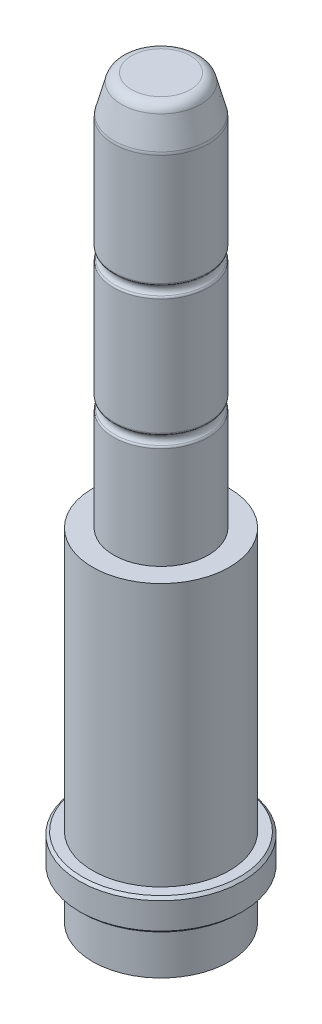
ISO-10303-21;
HEADER;
FILE_DESCRIPTION(('STEP AP214'),'2;1');
FILE_NAME('part.step','',(''),(''),'','','');
FILE_SCHEMA(('AUTOMOTIVE_DESIGN { 1 0 10303 214 1 1 1 1 }'));
ENDSEC;
DATA;
#1=APPLICATION_CONTEXT('core data for automotive mechanical design processes');
#2=APPLICATION_PROTOCOL_DEFINITION('international standard','automotive_design',2000,#1);
#3=PRODUCT_CONTEXT('',#1,'mechanical');
#4=PRODUCT('Part','Part','',(#3));
#5=PRODUCT_RELATED_PRODUCT_CATEGORY('part','',(#4));
#6=PRODUCT_DEFINITION_FORMATION('','',#4);
#7=PRODUCT_DEFINITION_CONTEXT('part definition',#1,'design');
#8=PRODUCT_DEFINITION('design','',#6,#7);
#9=PRODUCT_DEFINITION_SHAPE('','',#8);
#10=(LENGTH_UNIT() NAMED_UNIT(*) SI_UNIT(.MILLI.,.METRE.));
#11=(NAMED_UNIT(*) PLANE_ANGLE_UNIT() SI_UNIT($,.RADIAN.));
#12=(NAMED_UNIT(*) SI_UNIT($,.STERADIAN.) SOLID_ANGLE_UNIT());
#13=UNCERTAINTY_MEASURE_WITH_UNIT(LENGTH_MEASURE(1.E-05),#10,'distance_accuracy_value','');
#14=(GEOMETRIC_REPRESENTATION_CONTEXT(3) GLOBAL_UNCERTAINTY_ASSIGNED_CONTEXT((#13)) GLOBAL_UNIT_ASSIGNED_CONTEXT((#10,
#11,#12)) REPRESENTATION_CONTEXT('',''));
#15=CARTESIAN_POINT('',(0.,0.,0.));
#16=DIRECTION('',(0.,0.,1.));
#17=DIRECTION('',(1.,0.,0.));
#18=AXIS2_PLACEMENT_3D('',#15,#16,#17);
#19=CARTESIAN_POINT('',(0.,6.,0.));
#20=DIRECTION('',(0.,-1.,0.));
#21=DIRECTION('',(0.,0.,-1.));
#22=AXIS2_PLACEMENT_3D('',#19,#20,#21);
#23=CYLINDRICAL_SURFACE('',#22,15.5);
#24=CARTESIAN_POINT('',(0.,5.5,0.));
#25=DIRECTION('',(0.,1.,0.));
#26=DIRECTION('',(0.,0.,1.));
#27=AXIS2_PLACEMENT_3D('',#24,#25,#26);
#28=CIRCLE('',#27,15.5);
#29=CARTESIAN_POINT('',(0.,5.5,15.5));
#30=VERTEX_POINT('',#29);
#31=EDGE_CURVE('E22',#30,#30,#28,.F.);
#32=ORIENTED_EDGE('',*,*,#31,.T.);
#33=EDGE_LOOP('',(#32));
#34=FACE_BOUND('',#33,.T.);
#35=CARTESIAN_POINT('',(0.,0.5,0.));
#36=DIRECTION('',(0.,1.,0.));
#37=DIRECTION('',(0.,0.,1.));
#38=AXIS2_PLACEMENT_3D('',#35,#36,#37);
#39=CIRCLE('',#38,15.5);
#40=CARTESIAN_POINT('',(0.,0.5,15.5));
#41=VERTEX_POINT('',#40);
#42=EDGE_CURVE('E30',#41,#41,#39,.T.);
#43=ORIENTED_EDGE('',*,*,#42,.T.);
#44=EDGE_LOOP('',(#43));
#45=FACE_BOUND('',#44,.T.);
#46=ADVANCED_FACE('F14',(#34,#45),#23,.T.);
#47=CARTESIAN_POINT('',(0.,6.,0.));
#48=DIRECTION('',(0.,1.,0.));
#49=DIRECTION('',(0.,0.,1.));
#50=AXIS2_PLACEMENT_3D('',#47,#48,#49);
#51=PLANE('',#50);
#52=CARTESIAN_POINT('',(0.,6.,0.));
#53=DIRECTION('',(0.,1.,0.));
#54=DIRECTION('',(0.,0.,1.));
#55=AXIS2_PLACEMENT_3D('',#52,#53,#54);
#56=CIRCLE('',#55,15.);
#57=CARTESIAN_POINT('',(0.,6.,15.));
#58=VERTEX_POINT('',#57);
#59=EDGE_CURVE('E37',#58,#58,#56,.T.);
#60=ORIENTED_EDGE('',*,*,#59,.T.);
#61=EDGE_LOOP('',(#60));
#62=FACE_BOUND('',#61,.T.);
#63=CARTESIAN_POINT('',(0.,6.,0.));
#64=DIRECTION('',(0.,-1.,0.));
#65=DIRECTION('',(0.,0.,-1.));
#66=AXIS2_PLACEMENT_3D('',#63,#64,#65);
#67=CIRCLE('',#66,13.);
#68=CARTESIAN_POINT('',(0.,6.,-13.));
#69=VERTEX_POINT('',#68);
#70=EDGE_CURVE('E48',#69,#69,#67,.T.);
#71=ORIENTED_EDGE('',*,*,#70,.T.);
#72=EDGE_LOOP('',(#71));
#73=FACE_BOUND('',#72,.T.);
#74=ADVANCED_FACE('F125',(#62,#73),#51,.T.);
#75=CARTESIAN_POINT('',(0.,0.,0.));
#76=DIRECTION('',(0.,1.,0.));
#77=DIRECTION('',(0.,0.,1.));
#78=AXIS2_PLACEMENT_3D('',#75,#76,#77);
#79=PLANE('',#78);
#80=CARTESIAN_POINT('',(0.,0.,0.));
#81=DIRECTION('',(0.,1.,0.));
#82=DIRECTION('',(0.,0.,1.));
#83=AXIS2_PLACEMENT_3D('',#80,#81,#82);
#84=CIRCLE('',#83,15.);
#85=CARTESIAN_POINT('',(0.,0.,15.));
#86=VERTEX_POINT('',#85);
#87=EDGE_CURVE('E9',#86,#86,#84,.F.);
#88=ORIENTED_EDGE('',*,*,#87,.T.);
#89=EDGE_LOOP('',(#88));
#90=FACE_BOUND('',#89,.T.);
#91=CARTESIAN_POINT('',(0.,0.,0.));
#92=DIRECTION('',(0.,1.,0.));
#93=DIRECTION('',(0.,0.,1.));
#94=AXIS2_PLACEMENT_3D('',#91,#92,#93);
#95=CIRCLE('',#94,13.);
#96=CARTESIAN_POINT('',(0.,0.,13.));
#97=VERTEX_POINT('',#96);
#98=EDGE_CURVE('E103',#97,#97,#95,.T.);
#99=ORIENTED_EDGE('',*,*,#98,.T.);
#100=EDGE_LOOP('',(#99));
#101=FACE_BOUND('',#100,.T.);
#102=ADVANCED_FACE('F108',(#90,#101),#79,.F.);
#103=CARTESIAN_POINT('',(0.,56.,0.));
#104=DIRECTION('',(0.,-1.,0.));
#105=DIRECTION('',(0.,0.,-1.));
#106=AXIS2_PLACEMENT_3D('',#103,#104,#105);
#107=PLANE('',#106);
#108=CARTESIAN_POINT('',(0.,56.,0.));
#109=DIRECTION('',(0.,1.,0.));
#110=DIRECTION('',(0.,0.,1.));
#111=AXIS2_PLACEMENT_3D('',#108,#109,#110);
#112=CIRCLE('',#111,9.);
#113=CARTESIAN_POINT('',(0.,56.,8.99999999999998));
#114=VERTEX_POINT('',#113);
#115=EDGE_CURVE('E43',#114,#114,#112,.T.);
#116=ORIENTED_EDGE('',*,*,#115,.F.);
#117=EDGE_LOOP('',(#116));
#118=FACE_BOUND('',#117,.T.);
#119=CARTESIAN_POINT('',(0.,56.,0.));
#120=DIRECTION('',(0.,-1.,0.));
#121=DIRECTION('',(0.,0.,-1.));
#122=AXIS2_PLACEMENT_3D('',#119,#120,#121);
#123=CIRCLE('',#122,13.);
#124=CARTESIAN_POINT('',(0.,56.,-13.));
#125=VERTEX_POINT('',#124);
#126=EDGE_CURVE('E44',#125,#125,#123,.T.);
#127=ORIENTED_EDGE('',*,*,#126,.F.);
#128=EDGE_LOOP('',(#127));
#129=FACE_BOUND('',#128,.T.);
#130=ADVANCED_FACE('F134',(#118,#129),#107,.F.);
#131=CARTESIAN_POINT('',(0.,6.,0.));
#132=DIRECTION('',(0.,-1.,0.));
#133=DIRECTION('',(0.,0.,-1.));
#134=AXIS2_PLACEMENT_3D('',#131,#132,#133);
#135=CYLINDRICAL_SURFACE('',#134,13.);
#136=ORIENTED_EDGE('',*,*,#70,.F.);
#137=EDGE_LOOP('',(#136));
#138=FACE_BOUND('',#137,.T.);
#139=ORIENTED_EDGE('',*,*,#126,.T.);
#140=EDGE_LOOP('',(#139));
#141=FACE_BOUND('',#140,.T.);
#142=ADVANCED_FACE('F138',(#138,#141),#135,.T.);
#143=CARTESIAN_POINT('',(0.,131.,0.));
#144=DIRECTION('',(0.,1.,0.));
#145=DIRECTION('',(0.,0.,1.));
#146=AXIS2_PLACEMENT_3D('',#143,#144,#145);
#147=PLANE('',#146);
#148=CARTESIAN_POINT('',(0.,131.,0.));
#149=DIRECTION('',(0.,1.,0.));
#150=DIRECTION('',(0.,0.,1.));
#151=AXIS2_PLACEMENT_3D('',#148,#149,#150);
#152=CIRCLE('',#151,5.5897016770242);
#153=CARTESIAN_POINT('',(0.,131.,5.5897016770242));
#154=VERTEX_POINT('',#153);
#155=EDGE_CURVE('E52',#154,#154,#152,.T.);
#156=ORIENTED_EDGE('',*,*,#155,.T.);
#157=EDGE_LOOP('',(#156));
#158=FACE_BOUND('',#157,.T.);
#159=ADVANCED_FACE('F142',(#158),#147,.T.);
#160=CARTESIAN_POINT('',(0.,129.,0.));
#161=DIRECTION('',(0.,1.,0.));
#162=DIRECTION('',(0.,0.,1.));
#163=AXIS2_PLACEMENT_3D('',#160,#161,#162);
#164=TOROIDAL_SURFACE('',#163,5.5897016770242,2.);
#165=CARTESIAN_POINT('',(0.,129.517638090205,0.));
#166=DIRECTION('',(0.,1.,0.));
#167=DIRECTION('',(0.,0.,1.));
#168=AXIS2_PLACEMENT_3D('',#165,#166,#167);
#169=CIRCLE('',#168,7.52155332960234);
#170=CARTESIAN_POINT('',(0.,129.517638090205,7.52155332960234));
#171=VERTEX_POINT('',#170);
#172=EDGE_CURVE('E56',#171,#171,#169,.T.);
#173=ORIENTED_EDGE('',*,*,#172,.T.);
#174=EDGE_LOOP('',(#173));
#175=FACE_BOUND('',#174,.T.);
#176=ORIENTED_EDGE('',*,*,#155,.F.);
#177=EDGE_LOOP('',(#176));
#178=FACE_BOUND('',#177,.T.);
#179=ADVANCED_FACE('F146',(#175,#178),#164,.T.);
#180=CARTESIAN_POINT('',(0.,129.517638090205,0.));
#181=DIRECTION('',(0.,-1.,0.));
#182=DIRECTION('',(0.,0.,-1.));
#183=AXIS2_PLACEMENT_3D('',#180,#181,#182);
#184=CONICAL_SURFACE('',#183,7.52155332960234,0.261799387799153);
#185=CARTESIAN_POINT('',(0.,124.25433309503,0.));
#186=DIRECTION('',(0.,1.,0.));
#187=DIRECTION('',(0.,0.,1.));
#188=AXIS2_PLACEMENT_3D('',#185,#186,#187);
#189=CIRCLE('',#188,8.93185165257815);
#190=CARTESIAN_POINT('',(0.,124.25433309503,8.93185165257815));
#191=VERTEX_POINT('',#190);
#192=EDGE_CURVE('E59',#191,#191,#189,.T.);
#193=ORIENTED_EDGE('',*,*,#192,.T.);
#194=EDGE_LOOP('',(#193));
#195=FACE_BOUND('',#194,.T.);
#196=ORIENTED_EDGE('',*,*,#172,.F.);
#197=EDGE_LOOP('',(#196));
#198=FACE_BOUND('',#197,.T.);
#199=ADVANCED_FACE('F150',(#195,#198),#184,.T.);
#200=CARTESIAN_POINT('',(0.,123.736695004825,0.));
#201=DIRECTION('',(0.,1.,0.));
#202=DIRECTION('',(0.,0.,1.));
#203=AXIS2_PLACEMENT_3D('',#200,#201,#202);
#204=TOROIDAL_SURFACE('',#203,7.,2.);
#205=CARTESIAN_POINT('',(0.,123.736695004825,0.));
#206=DIRECTION('',(0.,1.,0.));
#207=DIRECTION('',(0.,0.,1.));
#208=AXIS2_PLACEMENT_3D('',#205,#206,#207);
#209=CIRCLE('',#208,9.);
#210=CARTESIAN_POINT('',(0.,123.736695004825,9.));
#211=VERTEX_POINT('',#210);
#212=EDGE_CURVE('E63',#211,#211,#209,.T.);
#213=ORIENTED_EDGE('',*,*,#212,.T.);
#214=EDGE_LOOP('',(#213));
#215=FACE_BOUND('',#214,.T.);
#216=ORIENTED_EDGE('',*,*,#192,.F.);
#217=EDGE_LOOP('',(#216));
#218=FACE_BOUND('',#217,.T.);
#219=ADVANCED_FACE('F154',(#215,#218),#204,.T.);
#220=CARTESIAN_POINT('',(0.,131.,0.));
#221=DIRECTION('',(0.,1.,0.));
#222=DIRECTION('',(0.,0.,1.));
#223=AXIS2_PLACEMENT_3D('',#220,#221,#222);
#224=CYLINDRICAL_SURFACE('',#223,9.);
#225=CARTESIAN_POINT('',(0.,102.605352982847,0.));
#226=DIRECTION('',(0.,1.,0.));
#227=DIRECTION('',(0.,0.,1.));
#228=AXIS2_PLACEMENT_3D('',#225,#226,#227);
#229=CIRCLE('',#228,9.);
#230=CARTESIAN_POINT('',(0.,102.605352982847,8.99999999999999));
#231=VERTEX_POINT('',#230);
#232=EDGE_CURVE('E67',#231,#231,#229,.T.);
#233=ORIENTED_EDGE('',*,*,#232,.T.);
#234=EDGE_LOOP('',(#233));
#235=FACE_BOUND('',#234,.T.);
#236=ORIENTED_EDGE('',*,*,#212,.F.);
#237=EDGE_LOOP('',(#236));
#238=FACE_BOUND('',#237,.T.);
#239=ADVANCED_FACE('F158',(#235,#238),#224,.T.);
#240=CARTESIAN_POINT('',(0.,102.605352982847,0.));
#241=DIRECTION('',(0.,1.,0.));
#242=DIRECTION('',(0.,0.,1.));
#243=AXIS2_PLACEMENT_3D('',#240,#241,#242);
#244=TOROIDAL_SURFACE('',#243,8.5,0.5);
#245=CARTESIAN_POINT('',(0.,102.212277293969,0.));
#246=DIRECTION('',(0.,1.,0.));
#247=DIRECTION('',(0.,0.,1.));
#248=AXIS2_PLACEMENT_3D('',#245,#246,#247);
#249=CIRCLE('',#248,8.80901699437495);
#250=CARTESIAN_POINT('',(0.,102.212277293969,8.80901699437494));
#251=VERTEX_POINT('',#250);
#252=EDGE_CURVE('E71',#251,#251,#249,.T.);
#253=ORIENTED_EDGE('',*,*,#252,.T.);
#254=EDGE_LOOP('',(#253));
#255=FACE_BOUND('',#254,.T.);
#256=ORIENTED_EDGE('',*,*,#232,.F.);
#257=EDGE_LOOP('',(#256));
#258=FACE_BOUND('',#257,.T.);
#259=ADVANCED_FACE('F162',(#255,#258),#244,.T.);
#260=CARTESIAN_POINT('',(0.,101.333333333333,0.));
#261=DIRECTION('',(0.,1.,0.));
#262=DIRECTION('',(0.,0.,1.));
#263=AXIS2_PLACEMENT_3D('',#260,#261,#262);
#264=TOROIDAL_SURFACE('',#263,9.5,1.11803398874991);
#265=CARTESIAN_POINT('',(0.,100.454389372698,0.));
#266=DIRECTION('',(0.,1.,0.));
#267=DIRECTION('',(0.,0.,1.));
#268=AXIS2_PLACEMENT_3D('',#265,#266,#267);
#269=CIRCLE('',#268,8.80901699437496);
#270=CARTESIAN_POINT('',(0.,100.454389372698,8.80901699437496));
#271=VERTEX_POINT('',#270);
#272=EDGE_CURVE('E74',#271,#271,#269,.T.);
#273=ORIENTED_EDGE('',*,*,#272,.T.);
#274=EDGE_LOOP('',(#273));
#275=FACE_BOUND('',#274,.T.);
#276=ORIENTED_EDGE('',*,*,#252,.F.);
#277=EDGE_LOOP('',(#276));
#278=FACE_BOUND('',#277,.T.);
#279=ADVANCED_FACE('F166',(#275,#278),#264,.F.);
#280=CARTESIAN_POINT('',(0.,100.061313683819,0.));
#281=DIRECTION('',(0.,1.,0.));
#282=DIRECTION('',(0.,0.,1.));
#283=AXIS2_PLACEMENT_3D('',#280,#281,#282);
#284=TOROIDAL_SURFACE('',#283,8.5,0.5);
#285=CARTESIAN_POINT('',(0.,100.061313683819,0.));
#286=DIRECTION('',(0.,1.,0.));
#287=DIRECTION('',(0.,0.,1.));
#288=AXIS2_PLACEMENT_3D('',#285,#286,#287);
#289=CIRCLE('',#288,9.);
#290=CARTESIAN_POINT('',(0.,100.061313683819,8.99999999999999));
#291=VERTEX_POINT('',#290);
#292=EDGE_CURVE('E77',#291,#291,#289,.T.);
#293=ORIENTED_EDGE('',*,*,#292,.T.);
#294=EDGE_LOOP('',(#293));
#295=FACE_BOUND('',#294,.T.);
#296=ORIENTED_EDGE('',*,*,#272,.F.);
#297=EDGE_LOOP('',(#296));
#298=FACE_BOUND('',#297,.T.);
#299=ADVANCED_FACE('F170',(#295,#298),#284,.T.);
#300=CARTESIAN_POINT('',(0.,131.,0.));
#301=DIRECTION('',(0.,1.,0.));
#302=DIRECTION('',(0.,0.,1.));
#303=AXIS2_PLACEMENT_3D('',#300,#301,#302);
#304=CYLINDRICAL_SURFACE('',#303,9.);
#305=CARTESIAN_POINT('',(0.,77.9386863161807,0.));
#306=DIRECTION('',(0.,1.,0.));
#307=DIRECTION('',(0.,0.,1.));
#308=AXIS2_PLACEMENT_3D('',#305,#306,#307);
#309=CIRCLE('',#308,9.);
#310=CARTESIAN_POINT('',(0.,77.9386863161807,8.99999999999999));
#311=VERTEX_POINT('',#310);
#312=EDGE_CURVE('E81',#311,#311,#309,.T.);
#313=ORIENTED_EDGE('',*,*,#312,.T.);
#314=EDGE_LOOP('',(#313));
#315=FACE_BOUND('',#314,.T.);
#316=ORIENTED_EDGE('',*,*,#292,.F.);
#317=EDGE_LOOP('',(#316));
#318=FACE_BOUND('',#317,.T.);
#319=ADVANCED_FACE('F174',(#315,#318),#304,.T.);
#320=CARTESIAN_POINT('',(0.,77.9386863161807,0.));
#321=DIRECTION('',(0.,1.,0.));
#322=DIRECTION('',(0.,0.,1.));
#323=AXIS2_PLACEMENT_3D('',#320,#321,#322);
#324=TOROIDAL_SURFACE('',#323,8.5,0.5);
#325=CARTESIAN_POINT('',(0.,77.545610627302,0.));
#326=DIRECTION('',(0.,1.,0.));
#327=DIRECTION('',(0.,0.,1.));
#328=AXIS2_PLACEMENT_3D('',#325,#326,#327);
#329=CIRCLE('',#328,8.80901699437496);
#330=CARTESIAN_POINT('',(0.,77.545610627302,8.80901699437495));
#331=VERTEX_POINT('',#330);
#332=EDGE_CURVE('E85',#331,#331,#329,.T.);
#333=ORIENTED_EDGE('',*,*,#332,.T.);
#334=EDGE_LOOP('',(#333));
#335=FACE_BOUND('',#334,.T.);
#336=ORIENTED_EDGE('',*,*,#312,.F.);
#337=EDGE_LOOP('',(#336));
#338=FACE_BOUND('',#337,.T.);
#339=ADVANCED_FACE('F178',(#335,#338),#324,.T.);
#340=CARTESIAN_POINT('',(0.,76.6666666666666,0.));
#341=DIRECTION('',(0.,1.,0.));
#342=DIRECTION('',(0.,0.,1.));
#343=AXIS2_PLACEMENT_3D('',#340,#341,#342);
#344=TOROIDAL_SURFACE('',#343,9.5,1.11803398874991);
#345=CARTESIAN_POINT('',(0.,75.7877227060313,0.));
#346=DIRECTION('',(0.,1.,0.));
#347=DIRECTION('',(0.,0.,1.));
#348=AXIS2_PLACEMENT_3D('',#345,#346,#347);
#349=CIRCLE('',#348,8.80901699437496);
#350=CARTESIAN_POINT('',(0.,75.7877227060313,8.80901699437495));
#351=VERTEX_POINT('',#350);
#352=EDGE_CURVE('E89',#351,#351,#349,.T.);
#353=ORIENTED_EDGE('',*,*,#352,.T.);
#354=EDGE_LOOP('',(#353));
#355=FACE_BOUND('',#354,.T.);
#356=ORIENTED_EDGE('',*,*,#332,.F.);
#357=EDGE_LOOP('',(#356));
#358=FACE_BOUND('',#357,.T.);
#359=ADVANCED_FACE('F182',(#355,#358),#344,.F.);
#360=CARTESIAN_POINT('',(0.,75.3946470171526,0.));
#361=DIRECTION('',(0.,1.,0.));
#362=DIRECTION('',(0.,0.,1.));
#363=AXIS2_PLACEMENT_3D('',#360,#361,#362);
#364=TOROIDAL_SURFACE('',#363,8.5,0.5);
#365=CARTESIAN_POINT('',(0.,75.3946470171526,0.));
#366=DIRECTION('',(0.,1.,0.));
#367=DIRECTION('',(0.,0.,1.));
#368=AXIS2_PLACEMENT_3D('',#365,#366,#367);
#369=CIRCLE('',#368,9.);
#370=CARTESIAN_POINT('',(0.,75.3946470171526,8.99999999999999));
#371=VERTEX_POINT('',#370);
#372=EDGE_CURVE('E93',#371,#371,#369,.T.);
#373=ORIENTED_EDGE('',*,*,#372,.T.);
#374=EDGE_LOOP('',(#373));
#375=FACE_BOUND('',#374,.T.);
#376=ORIENTED_EDGE('',*,*,#352,.F.);
#377=EDGE_LOOP('',(#376));
#378=FACE_BOUND('',#377,.T.);
#379=ADVANCED_FACE('F186',(#375,#378),#364,.T.);
#380=CARTESIAN_POINT('',(0.,131.,0.));
#381=DIRECTION('',(0.,1.,0.));
#382=DIRECTION('',(0.,0.,1.));
#383=AXIS2_PLACEMENT_3D('',#380,#381,#382);
#384=CYLINDRICAL_SURFACE('',#383,9.);
#385=ORIENTED_EDGE('',*,*,#115,.T.);
#386=EDGE_LOOP('',(#385));
#387=FACE_BOUND('',#386,.T.);
#388=ORIENTED_EDGE('',*,*,#372,.F.);
#389=EDGE_LOOP('',(#388));
#390=FACE_BOUND('',#389,.T.);
#391=ADVANCED_FACE('F121',(#387,#390),#384,.T.);
#392=CARTESIAN_POINT('',(0.,-9.,0.));
#393=DIRECTION('',(0.,-1.,0.));
#394=DIRECTION('',(0.,0.,-1.));
#395=AXIS2_PLACEMENT_3D('',#392,#393,#394);
#396=PLANE('',#395);
#397=CARTESIAN_POINT('',(0.,-9.,0.));
#398=DIRECTION('',(0.,1.,0.));
#399=DIRECTION('',(0.,0.,1.));
#400=AXIS2_PLACEMENT_3D('',#397,#398,#399);
#401=CIRCLE('',#400,13.);
#402=CARTESIAN_POINT('',(0.,-9.,13.));
#403=VERTEX_POINT('',#402);
#404=EDGE_CURVE('E96',#403,#403,#401,.T.);
#405=ORIENTED_EDGE('',*,*,#404,.F.);
#406=EDGE_LOOP('',(#405));
#407=FACE_BOUND('',#406,.T.);
#408=ADVANCED_FACE('F113',(#407),#396,.T.);
#409=CARTESIAN_POINT('',(0.,0.,0.));
#410=DIRECTION('',(0.,1.,0.));
#411=DIRECTION('',(0.,0.,1.));
#412=AXIS2_PLACEMENT_3D('',#409,#410,#411);
#413=CYLINDRICAL_SURFACE('',#412,13.);
#414=ORIENTED_EDGE('',*,*,#404,.T.);
#415=EDGE_LOOP('',(#414));
#416=FACE_BOUND('',#415,.T.);
#417=ORIENTED_EDGE('',*,*,#98,.F.);
#418=EDGE_LOOP('',(#417));
#419=FACE_BOUND('',#418,.T.);
#420=ADVANCED_FACE('F110',(#416,#419),#413,.T.);
#421=CARTESIAN_POINT('',(0.,6.,0.));
#422=DIRECTION('',(0.,-1.,0.));
#423=DIRECTION('',(0.,0.,-1.));
#424=AXIS2_PLACEMENT_3D('',#421,#422,#423);
#425=CONICAL_SURFACE('',#424,15.,0.785398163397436);
#426=ORIENTED_EDGE('',*,*,#31,.F.);
#427=EDGE_LOOP('',(#426));
#428=FACE_BOUND('',#427,.T.);
#429=ORIENTED_EDGE('',*,*,#59,.F.);
#430=EDGE_LOOP('',(#429));
#431=FACE_BOUND('',#430,.T.);
#432=ADVANCED_FACE('F112',(#428,#431),#425,.T.);
#433=CARTESIAN_POINT('',(0.,0.5,0.));
#434=DIRECTION('',(0.,1.,0.));
#435=DIRECTION('',(0.,0.,1.));
#436=AXIS2_PLACEMENT_3D('',#433,#434,#435);
#437=CONICAL_SURFACE('',#436,15.5,0.785398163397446);
#438=ORIENTED_EDGE('',*,*,#87,.F.);
#439=EDGE_LOOP('',(#438));
#440=FACE_BOUND('',#439,.T.);
#441=ORIENTED_EDGE('',*,*,#42,.F.);
#442=EDGE_LOOP('',(#441));
#443=FACE_BOUND('',#442,.T.);
#444=ADVANCED_FACE('F16',(#440,#443),#437,.T.);
#445=CLOSED_SHELL('',(#46,#74,#102,#130,#142,#159,#179,#199,#219,#239,#259,#279,#299,#319,#339,
#359,#379,#391,#408,#420,#432,#444));
#446=MANIFOLD_SOLID_BREP('B1',#445);
#447=ADVANCED_BREP_SHAPE_REPRESENTATION('',(#18,#446),#14);
#448=SHAPE_DEFINITION_REPRESENTATION(#9,#447);
ENDSEC;
END-ISO-10303-21;
